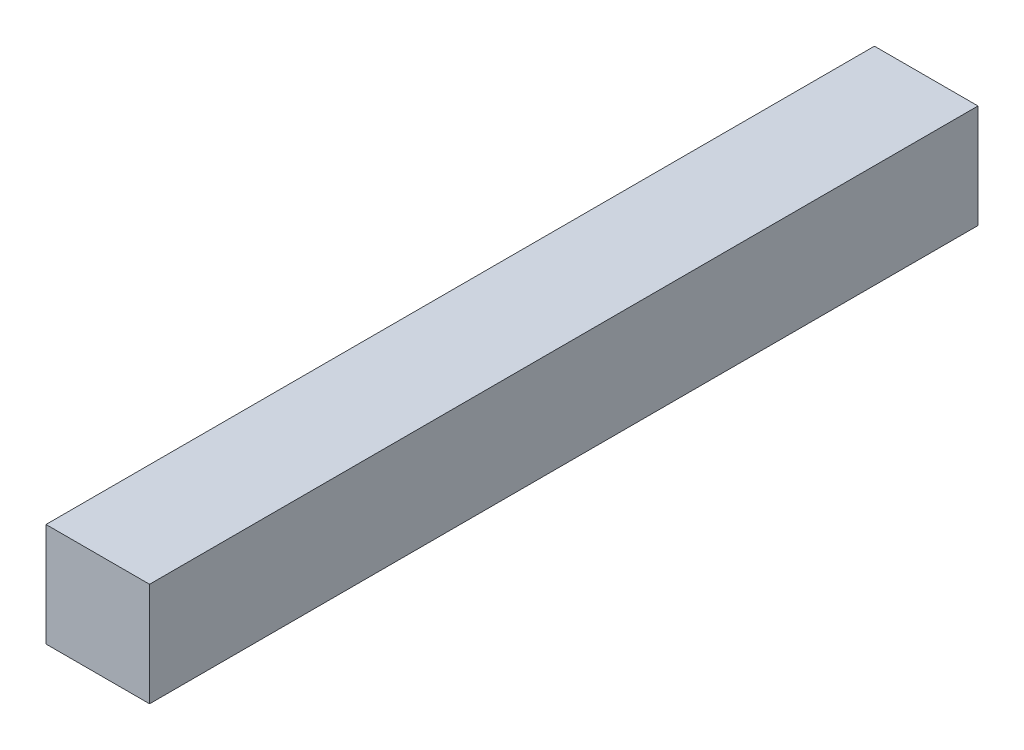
from build123d import *

# Parameters (mm, degrees)
ESQUISSE1_W      = 25
ESQUISSE1_H      = 25
EXTRUSION1_DEPTH = 200


with BuildPart() as part:
    # Esquisse1 → Extrusion1 (new body)
    with BuildSketch(Plane.XY):
        with Locations((12.5, 12.5)):
            Rectangle(ESQUISSE1_W, ESQUISSE1_H)
    extrude(amount=EXTRUSION1_DEPTH)


solid = part.part
